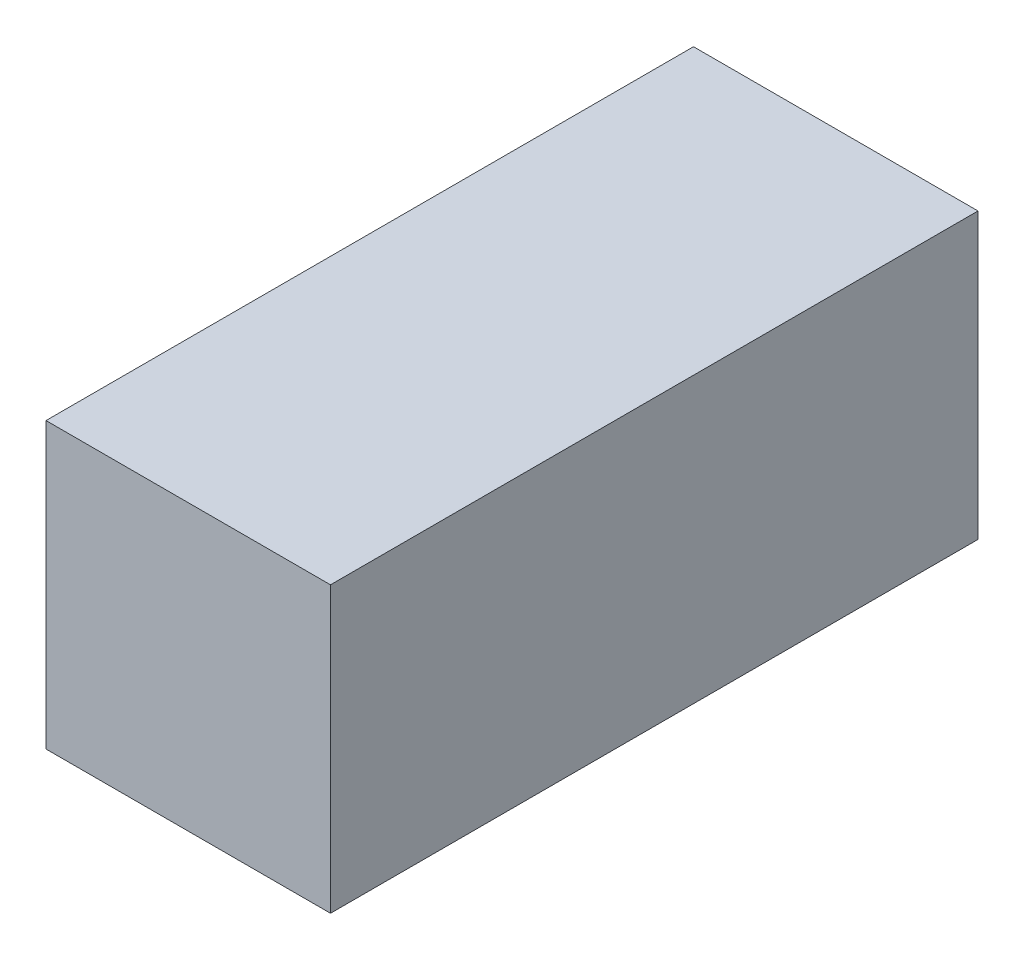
ISO-10303-21;
HEADER;
FILE_DESCRIPTION(('STEP AP214'),'2;1');
FILE_NAME('part.step','',(''),(''),'','','');
FILE_SCHEMA(('AUTOMOTIVE_DESIGN { 1 0 10303 214 1 1 1 1 }'));
ENDSEC;
DATA;
#1=APPLICATION_CONTEXT('core data for automotive mechanical design processes');
#2=APPLICATION_PROTOCOL_DEFINITION('international standard','automotive_design',2000,#1);
#3=PRODUCT_CONTEXT('',#1,'mechanical');
#4=PRODUCT('Part','Part','',(#3));
#5=PRODUCT_RELATED_PRODUCT_CATEGORY('part','',(#4));
#6=PRODUCT_DEFINITION_FORMATION('','',#4);
#7=PRODUCT_DEFINITION_CONTEXT('part definition',#1,'design');
#8=PRODUCT_DEFINITION('design','',#6,#7);
#9=PRODUCT_DEFINITION_SHAPE('','',#8);
#10=(LENGTH_UNIT() NAMED_UNIT(*) SI_UNIT(.MILLI.,.METRE.));
#11=(NAMED_UNIT(*) PLANE_ANGLE_UNIT() SI_UNIT($,.RADIAN.));
#12=(NAMED_UNIT(*) SI_UNIT($,.STERADIAN.) SOLID_ANGLE_UNIT());
#13=UNCERTAINTY_MEASURE_WITH_UNIT(LENGTH_MEASURE(1.E-05),#10,'distance_accuracy_value','');
#14=(GEOMETRIC_REPRESENTATION_CONTEXT(3) GLOBAL_UNCERTAINTY_ASSIGNED_CONTEXT((#13)) GLOBAL_UNIT_ASSIGNED_CONTEXT((#10,
#11,#12)) REPRESENTATION_CONTEXT('',''));
#15=CARTESIAN_POINT('',(0.,0.,0.));
#16=DIRECTION('',(0.,0.,1.));
#17=DIRECTION('',(1.,0.,0.));
#18=AXIS2_PLACEMENT_3D('',#15,#16,#17);
#19=CARTESIAN_POINT('',(-17.018,-17.018,77.47));
#20=DIRECTION('',(1.,0.,0.));
#21=DIRECTION('',(0.,0.,-1.));
#22=AXIS2_PLACEMENT_3D('',#19,#20,#21);
#23=PLANE('',#22);
#24=DIRECTION('',(0.,-1.,0.));
#25=VECTOR('',#24,1.);
#26=CARTESIAN_POINT('',(-17.018,-17.018,0.));
#27=LINE('',#26,#25);
#28=CARTESIAN_POINT('',(-17.018,17.018,0.));
#29=VERTEX_POINT('',#28);
#30=CARTESIAN_POINT('',(-17.018,-17.018,0.));
#31=VERTEX_POINT('',#30);
#32=EDGE_CURVE('E111',#29,#31,#27,.T.);
#33=ORIENTED_EDGE('',*,*,#32,.T.);
#34=DIRECTION('',(0.,0.,-1.));
#35=VECTOR('',#34,1.);
#36=CARTESIAN_POINT('',(-17.018,-17.018,77.47));
#37=LINE('',#36,#35);
#38=CARTESIAN_POINT('',(-17.018,-17.018,77.47));
#39=VERTEX_POINT('',#38);
#40=EDGE_CURVE('E11',#39,#31,#37,.T.);
#41=ORIENTED_EDGE('',*,*,#40,.F.);
#42=DIRECTION('',(0.,-1.,0.));
#43=VECTOR('',#42,1.);
#44=CARTESIAN_POINT('',(-17.018,-17.018,77.47));
#45=LINE('',#44,#43);
#46=CARTESIAN_POINT('',(-17.018,17.018,77.47));
#47=VERTEX_POINT('',#46);
#48=EDGE_CURVE('E100',#47,#39,#45,.T.);
#49=ORIENTED_EDGE('',*,*,#48,.F.);
#50=DIRECTION('',(0.,0.,-1.));
#51=VECTOR('',#50,1.);
#52=CARTESIAN_POINT('',(-17.018,17.018,77.47));
#53=LINE('',#52,#51);
#54=EDGE_CURVE('E108',#47,#29,#53,.T.);
#55=ORIENTED_EDGE('',*,*,#54,.T.);
#56=EDGE_LOOP('',(#33,#41,#49,#55));
#57=FACE_BOUND('',#56,.T.);
#58=ADVANCED_FACE('F44',(#57),#23,.F.);
#59=CARTESIAN_POINT('',(17.018,-17.018,77.47));
#60=DIRECTION('',(0.,1.,0.));
#61=DIRECTION('',(-1.,0.,0.));
#62=AXIS2_PLACEMENT_3D('',#59,#60,#61);
#63=PLANE('',#62);
#64=DIRECTION('',(1.,0.,0.));
#65=VECTOR('',#64,1.);
#66=CARTESIAN_POINT('',(17.018,-17.018,0.));
#67=LINE('',#66,#65);
#68=CARTESIAN_POINT('',(17.018,-17.018,0.));
#69=VERTEX_POINT('',#68);
#70=EDGE_CURVE('E105',#31,#69,#67,.T.);
#71=ORIENTED_EDGE('',*,*,#70,.T.);
#72=DIRECTION('',(0.,0.,-1.));
#73=VECTOR('',#72,1.);
#74=CARTESIAN_POINT('',(17.018,-17.018,77.47));
#75=LINE('',#74,#73);
#76=CARTESIAN_POINT('',(17.018,-17.018,77.47));
#77=VERTEX_POINT('',#76);
#78=EDGE_CURVE('E53',#77,#69,#75,.T.);
#79=ORIENTED_EDGE('',*,*,#78,.F.);
#80=DIRECTION('',(1.,0.,0.));
#81=VECTOR('',#80,1.);
#82=CARTESIAN_POINT('',(17.018,-17.018,77.47));
#83=LINE('',#82,#81);
#84=EDGE_CURVE('E95',#39,#77,#83,.T.);
#85=ORIENTED_EDGE('',*,*,#84,.F.);
#86=ORIENTED_EDGE('',*,*,#40,.T.);
#87=EDGE_LOOP('',(#71,#79,#85,#86));
#88=FACE_BOUND('',#87,.T.);
#89=ADVANCED_FACE('F102',(#88),#63,.F.);
#90=CARTESIAN_POINT('',(17.018,-17.018,77.47));
#91=DIRECTION('',(-1.,0.,0.));
#92=DIRECTION('',(0.,0.,1.));
#93=AXIS2_PLACEMENT_3D('',#90,#91,#92);
#94=PLANE('',#93);
#95=DIRECTION('',(0.,1.,0.));
#96=VECTOR('',#95,1.);
#97=CARTESIAN_POINT('',(17.018,-17.018,0.));
#98=LINE('',#97,#96);
#99=CARTESIAN_POINT('',(17.018,17.018,0.));
#100=VERTEX_POINT('',#99);
#101=EDGE_CURVE('E80',#69,#100,#98,.T.);
#102=ORIENTED_EDGE('',*,*,#101,.T.);
#103=DIRECTION('',(0.,0.,-1.));
#104=VECTOR('',#103,1.);
#105=CARTESIAN_POINT('',(17.018,17.018,77.47));
#106=LINE('',#105,#104);
#107=CARTESIAN_POINT('',(17.018,17.018,77.47));
#108=VERTEX_POINT('',#107);
#109=EDGE_CURVE('E101',#108,#100,#106,.T.);
#110=ORIENTED_EDGE('',*,*,#109,.F.);
#111=DIRECTION('',(0.,1.,0.));
#112=VECTOR('',#111,1.);
#113=CARTESIAN_POINT('',(17.018,-17.018,77.47));
#114=LINE('',#113,#112);
#115=EDGE_CURVE('E94',#77,#108,#114,.T.);
#116=ORIENTED_EDGE('',*,*,#115,.F.);
#117=ORIENTED_EDGE('',*,*,#78,.T.);
#118=EDGE_LOOP('',(#102,#110,#116,#117));
#119=FACE_BOUND('',#118,.T.);
#120=ADVANCED_FACE('F103',(#119),#94,.F.);
#121=CARTESIAN_POINT('',(17.018,17.018,77.47));
#122=DIRECTION('',(0.,-1.,0.));
#123=DIRECTION('',(0.,0.,-1.));
#124=AXIS2_PLACEMENT_3D('',#121,#122,#123);
#125=PLANE('',#124);
#126=DIRECTION('',(-1.,0.,0.));
#127=VECTOR('',#126,1.);
#128=CARTESIAN_POINT('',(17.018,17.018,0.));
#129=LINE('',#128,#127);
#130=EDGE_CURVE('E82',#100,#29,#129,.T.);
#131=ORIENTED_EDGE('',*,*,#130,.T.);
#132=ORIENTED_EDGE('',*,*,#54,.F.);
#133=DIRECTION('',(-1.,0.,0.));
#134=VECTOR('',#133,1.);
#135=CARTESIAN_POINT('',(17.018,17.018,77.47));
#136=LINE('',#135,#134);
#137=EDGE_CURVE('E62',#108,#47,#136,.T.);
#138=ORIENTED_EDGE('',*,*,#137,.F.);
#139=ORIENTED_EDGE('',*,*,#109,.T.);
#140=EDGE_LOOP('',(#131,#132,#138,#139));
#141=FACE_BOUND('',#140,.T.);
#142=ADVANCED_FACE('F128',(#141),#125,.F.);
#143=CARTESIAN_POINT('',(0.,0.,77.47));
#144=DIRECTION('',(0.,0.,1.));
#145=DIRECTION('',(1.,0.,0.));
#146=AXIS2_PLACEMENT_3D('',#143,#144,#145);
#147=PLANE('',#146);
#148=ORIENTED_EDGE('',*,*,#48,.T.);
#149=ORIENTED_EDGE('',*,*,#84,.T.);
#150=ORIENTED_EDGE('',*,*,#115,.T.);
#151=ORIENTED_EDGE('',*,*,#137,.T.);
#152=EDGE_LOOP('',(#148,#149,#150,#151));
#153=FACE_BOUND('',#152,.T.);
#154=ADVANCED_FACE('F93',(#153),#147,.T.);
#155=CARTESIAN_POINT('',(0.,0.,0.));
#156=DIRECTION('',(0.,0.,1.));
#157=DIRECTION('',(1.,0.,0.));
#158=AXIS2_PLACEMENT_3D('',#155,#156,#157);
#159=PLANE('',#158);
#160=ORIENTED_EDGE('',*,*,#32,.F.);
#161=ORIENTED_EDGE('',*,*,#130,.F.);
#162=ORIENTED_EDGE('',*,*,#101,.F.);
#163=ORIENTED_EDGE('',*,*,#70,.F.);
#164=EDGE_LOOP('',(#160,#161,#162,#163));
#165=FACE_BOUND('',#164,.T.);
#166=ADVANCED_FACE('F129',(#165),#159,.F.);
#167=CLOSED_SHELL('',(#58,#89,#120,#142,#154,#166));
#168=MANIFOLD_SOLID_BREP('B2',#167);
#169=ADVANCED_BREP_SHAPE_REPRESENTATION('',(#18,#168),#14);
#170=SHAPE_DEFINITION_REPRESENTATION(#9,#169);
ENDSEC;
END-ISO-10303-21;
